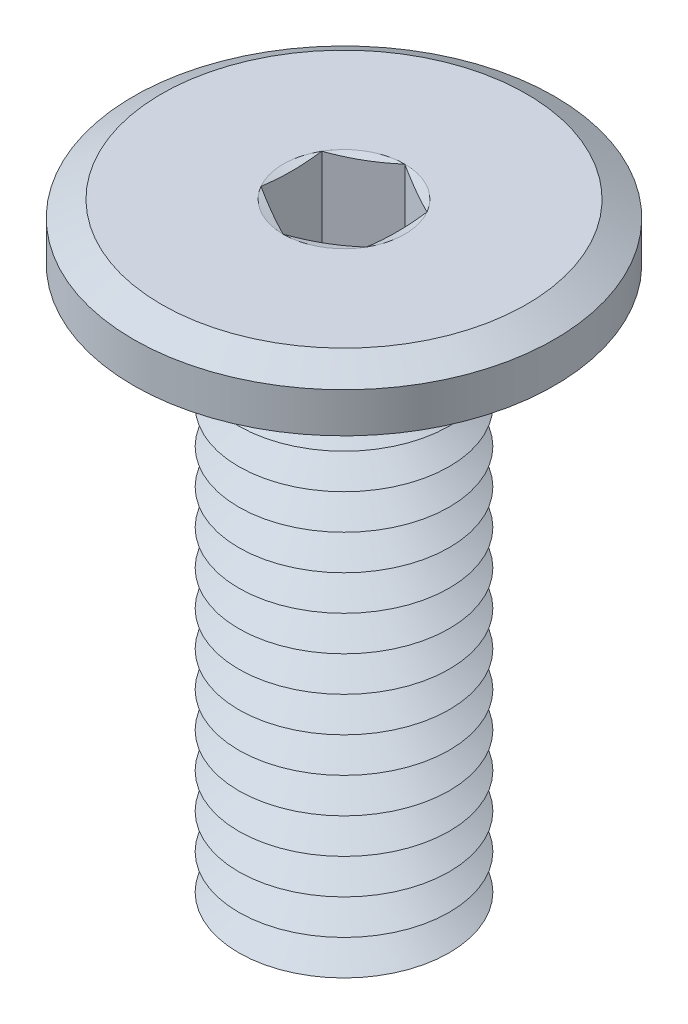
ISO-10303-21;
HEADER;
FILE_DESCRIPTION(('STEP AP214'),'2;1');
FILE_NAME('part.step','',(''),(''),'','','');
FILE_SCHEMA(('AUTOMOTIVE_DESIGN { 1 0 10303 214 1 1 1 1 }'));
ENDSEC;
DATA;
#1=APPLICATION_CONTEXT('core data for automotive mechanical design processes');
#2=APPLICATION_PROTOCOL_DEFINITION('international standard','automotive_design',2000,#1);
#3=PRODUCT_CONTEXT('',#1,'mechanical');
#4=PRODUCT('Part','Part','',(#3));
#5=PRODUCT_RELATED_PRODUCT_CATEGORY('part','',(#4));
#6=PRODUCT_DEFINITION_FORMATION('','',#4);
#7=PRODUCT_DEFINITION_CONTEXT('part definition',#1,'design');
#8=PRODUCT_DEFINITION('design','',#6,#7);
#9=PRODUCT_DEFINITION_SHAPE('','',#8);
#10=(LENGTH_UNIT() NAMED_UNIT(*) SI_UNIT(.MILLI.,.METRE.));
#11=(NAMED_UNIT(*) PLANE_ANGLE_UNIT() SI_UNIT($,.RADIAN.));
#12=(NAMED_UNIT(*) SI_UNIT($,.STERADIAN.) SOLID_ANGLE_UNIT());
#13=UNCERTAINTY_MEASURE_WITH_UNIT(LENGTH_MEASURE(1.E-05),#10,'distance_accuracy_value','');
#14=(GEOMETRIC_REPRESENTATION_CONTEXT(3) GLOBAL_UNCERTAINTY_ASSIGNED_CONTEXT((#13)) GLOBAL_UNIT_ASSIGNED_CONTEXT((#10,
#11,#12)) REPRESENTATION_CONTEXT('',''));
#15=CARTESIAN_POINT('',(0.,0.,0.));
#16=DIRECTION('',(0.,0.,1.));
#17=DIRECTION('',(1.,0.,0.));
#18=AXIS2_PLACEMENT_3D('',#15,#16,#17);
#19=CARTESIAN_POINT('',(0.,-8.05,0.));
#20=DIRECTION('',(0.,-1.,0.));
#21=DIRECTION('',(0.,0.,-1.));
#22=AXIS2_PLACEMENT_3D('',#19,#20,#21);
#23=CONICAL_SURFACE('',#22,1.5,1.0471975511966);
#24=CARTESIAN_POINT('',(0.,-7.8,0.));
#25=DIRECTION('',(0.,1.,0.));
#26=DIRECTION('',(0.,0.,1.));
#27=AXIS2_PLACEMENT_3D('',#24,#25,#26);
#28=CIRCLE('',#27,1.06698729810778);
#29=CARTESIAN_POINT('',(0.,-7.8,1.06698729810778));
#30=VERTEX_POINT('',#29);
#31=EDGE_CURVE('E472',#30,#30,#28,.T.);
#32=ORIENTED_EDGE('',*,*,#31,.F.);
#33=EDGE_LOOP('',(#32));
#34=FACE_BOUND('',#33,.T.);
#35=CARTESIAN_POINT('',(0.,-8.05,0.));
#36=DIRECTION('',(0.,1.,0.));
#37=DIRECTION('',(0.,0.,1.));
#38=AXIS2_PLACEMENT_3D('',#35,#36,#37);
#39=CIRCLE('',#38,1.5);
#40=CARTESIAN_POINT('',(0.,-8.05,1.5));
#41=VERTEX_POINT('',#40);
#42=EDGE_CURVE('E476',#41,#41,#39,.T.);
#43=ORIENTED_EDGE('',*,*,#42,.T.);
#44=EDGE_LOOP('',(#43));
#45=FACE_BOUND('',#44,.T.);
#46=ADVANCED_FACE('F39',(#34,#45),#23,.T.);
#47=CARTESIAN_POINT('',(0.,-7.8,0.));
#48=DIRECTION('',(0.,1.,0.));
#49=DIRECTION('',(0.,0.,1.));
#50=AXIS2_PLACEMENT_3D('',#47,#48,#49);
#51=CONICAL_SURFACE('',#50,1.06698729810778,1.0471975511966);
#52=CARTESIAN_POINT('',(0.,-7.55,0.));
#53=DIRECTION('',(0.,1.,0.));
#54=DIRECTION('',(0.,0.,1.));
#55=AXIS2_PLACEMENT_3D('',#52,#53,#54);
#56=CIRCLE('',#55,1.5);
#57=CARTESIAN_POINT('',(0.,-7.55,1.5));
#58=VERTEX_POINT('',#57);
#59=EDGE_CURVE('E469',#58,#58,#56,.T.);
#60=ORIENTED_EDGE('',*,*,#59,.F.);
#61=EDGE_LOOP('',(#60));
#62=FACE_BOUND('',#61,.T.);
#63=ORIENTED_EDGE('',*,*,#31,.T.);
#64=EDGE_LOOP('',(#63));
#65=FACE_BOUND('',#64,.T.);
#66=ADVANCED_FACE('F232',(#62,#65),#51,.T.);
#67=CARTESIAN_POINT('',(0.,-8.8,0.));
#68=DIRECTION('',(0.,-1.,0.));
#69=DIRECTION('',(0.,0.,-1.));
#70=AXIS2_PLACEMENT_3D('',#67,#68,#69);
#71=PLANE('',#70);
#72=CARTESIAN_POINT('',(0.,-8.8,0.));
#73=DIRECTION('',(0.,1.,0.));
#74=DIRECTION('',(0.,0.,1.));
#75=AXIS2_PLACEMENT_3D('',#72,#73,#74);
#76=CIRCLE('',#75,1.06698729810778);
#77=CARTESIAN_POINT('',(0.,-8.8,1.06698729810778));
#78=VERTEX_POINT('',#77);
#79=EDGE_CURVE('E298',#78,#78,#76,.T.);
#80=ORIENTED_EDGE('',*,*,#79,.F.);
#81=EDGE_LOOP('',(#80));
#82=FACE_BOUND('',#81,.T.);
#83=ADVANCED_FACE('F238',(#82),#71,.T.);
#84=CARTESIAN_POINT('',(0.,-8.8,0.));
#85=DIRECTION('',(0.,1.,0.));
#86=DIRECTION('',(0.,0.,1.));
#87=AXIS2_PLACEMENT_3D('',#84,#85,#86);
#88=CONICAL_SURFACE('',#87,1.06698729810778,1.0471975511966);
#89=CARTESIAN_POINT('',(0.,-8.55,0.));
#90=DIRECTION('',(0.,1.,0.));
#91=DIRECTION('',(0.,0.,1.));
#92=AXIS2_PLACEMENT_3D('',#89,#90,#91);
#93=CIRCLE('',#92,1.5);
#94=CARTESIAN_POINT('',(0.,-8.55,1.5));
#95=VERTEX_POINT('',#94);
#96=EDGE_CURVE('E484',#95,#95,#93,.T.);
#97=ORIENTED_EDGE('',*,*,#96,.F.);
#98=EDGE_LOOP('',(#97));
#99=FACE_BOUND('',#98,.T.);
#100=ORIENTED_EDGE('',*,*,#79,.T.);
#101=EDGE_LOOP('',(#100));
#102=FACE_BOUND('',#101,.T.);
#103=ADVANCED_FACE('F253',(#99,#102),#88,.T.);
#104=CARTESIAN_POINT('',(0.,-8.55,0.));
#105=DIRECTION('',(0.,-1.,0.));
#106=DIRECTION('',(0.,0.,-1.));
#107=AXIS2_PLACEMENT_3D('',#104,#105,#106);
#108=CONICAL_SURFACE('',#107,1.5,1.0471975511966);
#109=CARTESIAN_POINT('',(0.,-8.3,0.));
#110=DIRECTION('',(0.,1.,0.));
#111=DIRECTION('',(0.,0.,1.));
#112=AXIS2_PLACEMENT_3D('',#109,#110,#111);
#113=CIRCLE('',#112,1.06698729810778);
#114=CARTESIAN_POINT('',(0.,-8.3,1.06698729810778));
#115=VERTEX_POINT('',#114);
#116=EDGE_CURVE('E480',#115,#115,#113,.T.);
#117=ORIENTED_EDGE('',*,*,#116,.F.);
#118=EDGE_LOOP('',(#117));
#119=FACE_BOUND('',#118,.T.);
#120=ORIENTED_EDGE('',*,*,#96,.T.);
#121=EDGE_LOOP('',(#120));
#122=FACE_BOUND('',#121,.T.);
#123=ADVANCED_FACE('F249',(#119,#122),#108,.T.);
#124=CARTESIAN_POINT('',(0.,-8.3,0.));
#125=DIRECTION('',(0.,1.,0.));
#126=DIRECTION('',(0.,0.,1.));
#127=AXIS2_PLACEMENT_3D('',#124,#125,#126);
#128=CONICAL_SURFACE('',#127,1.06698729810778,1.0471975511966);
#129=ORIENTED_EDGE('',*,*,#42,.F.);
#130=EDGE_LOOP('',(#129));
#131=FACE_BOUND('',#130,.T.);
#132=ORIENTED_EDGE('',*,*,#116,.T.);
#133=EDGE_LOOP('',(#132));
#134=FACE_BOUND('',#133,.T.);
#135=ADVANCED_FACE('F245',(#131,#134),#128,.T.);
#136=CARTESIAN_POINT('',(0.,-7.55,0.));
#137=DIRECTION('',(0.,-1.,0.));
#138=DIRECTION('',(0.,0.,-1.));
#139=AXIS2_PLACEMENT_3D('',#136,#137,#138);
#140=CONICAL_SURFACE('',#139,1.5,1.0471975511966);
#141=CARTESIAN_POINT('',(0.,-7.3,0.));
#142=DIRECTION('',(0.,1.,0.));
#143=DIRECTION('',(0.,0.,1.));
#144=AXIS2_PLACEMENT_3D('',#141,#142,#143);
#145=CIRCLE('',#144,1.06698729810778);
#146=CARTESIAN_POINT('',(0.,-7.3,1.06698729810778));
#147=VERTEX_POINT('',#146);
#148=EDGE_CURVE('E466',#147,#147,#145,.T.);
#149=ORIENTED_EDGE('',*,*,#148,.F.);
#150=EDGE_LOOP('',(#149));
#151=FACE_BOUND('',#150,.T.);
#152=ORIENTED_EDGE('',*,*,#59,.T.);
#153=EDGE_LOOP('',(#152));
#154=FACE_BOUND('',#153,.T.);
#155=ADVANCED_FACE('F248',(#151,#154),#140,.T.);
#156=CARTESIAN_POINT('',(0.,-7.3,0.));
#157=DIRECTION('',(0.,1.,0.));
#158=DIRECTION('',(0.,0.,1.));
#159=AXIS2_PLACEMENT_3D('',#156,#157,#158);
#160=CONICAL_SURFACE('',#159,1.06698729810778,1.0471975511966);
#161=CARTESIAN_POINT('',(0.,-7.05,0.));
#162=DIRECTION('',(0.,1.,0.));
#163=DIRECTION('',(0.,0.,1.));
#164=AXIS2_PLACEMENT_3D('',#161,#162,#163);
#165=CIRCLE('',#164,1.5);
#166=CARTESIAN_POINT('',(0.,-7.05,1.5));
#167=VERTEX_POINT('',#166);
#168=EDGE_CURVE('E462',#167,#167,#165,.T.);
#169=ORIENTED_EDGE('',*,*,#168,.F.);
#170=EDGE_LOOP('',(#169));
#171=FACE_BOUND('',#170,.T.);
#172=ORIENTED_EDGE('',*,*,#148,.T.);
#173=EDGE_LOOP('',(#172));
#174=FACE_BOUND('',#173,.T.);
#175=ADVANCED_FACE('F635',(#171,#174),#160,.T.);
#176=CARTESIAN_POINT('',(0.,-7.05,0.));
#177=DIRECTION('',(0.,-1.,0.));
#178=DIRECTION('',(0.,0.,-1.));
#179=AXIS2_PLACEMENT_3D('',#176,#177,#178);
#180=CONICAL_SURFACE('',#179,1.5,1.0471975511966);
#181=CARTESIAN_POINT('',(0.,-6.8,0.));
#182=DIRECTION('',(0.,1.,0.));
#183=DIRECTION('',(0.,0.,1.));
#184=AXIS2_PLACEMENT_3D('',#181,#182,#183);
#185=CIRCLE('',#184,1.06698729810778);
#186=CARTESIAN_POINT('',(0.,-6.8,1.06698729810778));
#187=VERTEX_POINT('',#186);
#188=EDGE_CURVE('E458',#187,#187,#185,.T.);
#189=ORIENTED_EDGE('',*,*,#188,.F.);
#190=EDGE_LOOP('',(#189));
#191=FACE_BOUND('',#190,.T.);
#192=ORIENTED_EDGE('',*,*,#168,.T.);
#193=EDGE_LOOP('',(#192));
#194=FACE_BOUND('',#193,.T.);
#195=ADVANCED_FACE('F631',(#191,#194),#180,.T.);
#196=CARTESIAN_POINT('',(0.,-6.8,0.));
#197=DIRECTION('',(0.,1.,0.));
#198=DIRECTION('',(0.,0.,1.));
#199=AXIS2_PLACEMENT_3D('',#196,#197,#198);
#200=CONICAL_SURFACE('',#199,1.06698729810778,1.0471975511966);
#201=CARTESIAN_POINT('',(0.,-6.55,0.));
#202=DIRECTION('',(0.,1.,0.));
#203=DIRECTION('',(0.,0.,1.));
#204=AXIS2_PLACEMENT_3D('',#201,#202,#203);
#205=CIRCLE('',#204,1.5);
#206=CARTESIAN_POINT('',(0.,-6.55,1.5));
#207=VERTEX_POINT('',#206);
#208=EDGE_CURVE('E454',#207,#207,#205,.T.);
#209=ORIENTED_EDGE('',*,*,#208,.F.);
#210=EDGE_LOOP('',(#209));
#211=FACE_BOUND('',#210,.T.);
#212=ORIENTED_EDGE('',*,*,#188,.T.);
#213=EDGE_LOOP('',(#212));
#214=FACE_BOUND('',#213,.T.);
#215=ADVANCED_FACE('F627',(#211,#214),#200,.T.);
#216=CARTESIAN_POINT('',(0.,-6.55,0.));
#217=DIRECTION('',(0.,-1.,0.));
#218=DIRECTION('',(0.,0.,-1.));
#219=AXIS2_PLACEMENT_3D('',#216,#217,#218);
#220=CONICAL_SURFACE('',#219,1.5,1.0471975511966);
#221=CARTESIAN_POINT('',(0.,-6.3,0.));
#222=DIRECTION('',(0.,1.,0.));
#223=DIRECTION('',(0.,0.,1.));
#224=AXIS2_PLACEMENT_3D('',#221,#222,#223);
#225=CIRCLE('',#224,1.06698729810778);
#226=CARTESIAN_POINT('',(0.,-6.3,1.06698729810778));
#227=VERTEX_POINT('',#226);
#228=EDGE_CURVE('E450',#227,#227,#225,.T.);
#229=ORIENTED_EDGE('',*,*,#228,.F.);
#230=EDGE_LOOP('',(#229));
#231=FACE_BOUND('',#230,.T.);
#232=ORIENTED_EDGE('',*,*,#208,.T.);
#233=EDGE_LOOP('',(#232));
#234=FACE_BOUND('',#233,.T.);
#235=ADVANCED_FACE('F623',(#231,#234),#220,.T.);
#236=CARTESIAN_POINT('',(0.,-6.3,0.));
#237=DIRECTION('',(0.,1.,0.));
#238=DIRECTION('',(0.,0.,1.));
#239=AXIS2_PLACEMENT_3D('',#236,#237,#238);
#240=CONICAL_SURFACE('',#239,1.06698729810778,1.0471975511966);
#241=CARTESIAN_POINT('',(0.,-6.05,0.));
#242=DIRECTION('',(0.,1.,0.));
#243=DIRECTION('',(0.,0.,1.));
#244=AXIS2_PLACEMENT_3D('',#241,#242,#243);
#245=CIRCLE('',#244,1.5);
#246=CARTESIAN_POINT('',(0.,-6.05,1.5));
#247=VERTEX_POINT('',#246);
#248=EDGE_CURVE('E446',#247,#247,#245,.T.);
#249=ORIENTED_EDGE('',*,*,#248,.F.);
#250=EDGE_LOOP('',(#249));
#251=FACE_BOUND('',#250,.T.);
#252=ORIENTED_EDGE('',*,*,#228,.T.);
#253=EDGE_LOOP('',(#252));
#254=FACE_BOUND('',#253,.T.);
#255=ADVANCED_FACE('F619',(#251,#254),#240,.T.);
#256=CARTESIAN_POINT('',(0.,-6.05,0.));
#257=DIRECTION('',(0.,-1.,0.));
#258=DIRECTION('',(0.,0.,-1.));
#259=AXIS2_PLACEMENT_3D('',#256,#257,#258);
#260=CONICAL_SURFACE('',#259,1.5,1.0471975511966);
#261=CARTESIAN_POINT('',(0.,-5.8,0.));
#262=DIRECTION('',(0.,1.,0.));
#263=DIRECTION('',(0.,0.,1.));
#264=AXIS2_PLACEMENT_3D('',#261,#262,#263);
#265=CIRCLE('',#264,1.06698729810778);
#266=CARTESIAN_POINT('',(0.,-5.8,1.06698729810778));
#267=VERTEX_POINT('',#266);
#268=EDGE_CURVE('E442',#267,#267,#265,.T.);
#269=ORIENTED_EDGE('',*,*,#268,.F.);
#270=EDGE_LOOP('',(#269));
#271=FACE_BOUND('',#270,.T.);
#272=ORIENTED_EDGE('',*,*,#248,.T.);
#273=EDGE_LOOP('',(#272));
#274=FACE_BOUND('',#273,.T.);
#275=ADVANCED_FACE('F615',(#271,#274),#260,.T.);
#276=CARTESIAN_POINT('',(0.,-5.8,0.));
#277=DIRECTION('',(0.,1.,0.));
#278=DIRECTION('',(0.,0.,1.));
#279=AXIS2_PLACEMENT_3D('',#276,#277,#278);
#280=CONICAL_SURFACE('',#279,1.06698729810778,1.0471975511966);
#281=CARTESIAN_POINT('',(0.,-5.55,0.));
#282=DIRECTION('',(0.,1.,0.));
#283=DIRECTION('',(0.,0.,1.));
#284=AXIS2_PLACEMENT_3D('',#281,#282,#283);
#285=CIRCLE('',#284,1.5);
#286=CARTESIAN_POINT('',(0.,-5.55,1.5));
#287=VERTEX_POINT('',#286);
#288=EDGE_CURVE('E439',#287,#287,#285,.T.);
#289=ORIENTED_EDGE('',*,*,#288,.F.);
#290=EDGE_LOOP('',(#289));
#291=FACE_BOUND('',#290,.T.);
#292=ORIENTED_EDGE('',*,*,#268,.T.);
#293=EDGE_LOOP('',(#292));
#294=FACE_BOUND('',#293,.T.);
#295=ADVANCED_FACE('F611',(#291,#294),#280,.T.);
#296=CARTESIAN_POINT('',(0.,-5.55,0.));
#297=DIRECTION('',(0.,-1.,0.));
#298=DIRECTION('',(0.,0.,-1.));
#299=AXIS2_PLACEMENT_3D('',#296,#297,#298);
#300=CONICAL_SURFACE('',#299,1.5,1.0471975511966);
#301=CARTESIAN_POINT('',(0.,-5.3,0.));
#302=DIRECTION('',(0.,1.,0.));
#303=DIRECTION('',(0.,0.,1.));
#304=AXIS2_PLACEMENT_3D('',#301,#302,#303);
#305=CIRCLE('',#304,1.06698729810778);
#306=CARTESIAN_POINT('',(0.,-5.3,1.06698729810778));
#307=VERTEX_POINT('',#306);
#308=EDGE_CURVE('E435',#307,#307,#305,.T.);
#309=ORIENTED_EDGE('',*,*,#308,.F.);
#310=EDGE_LOOP('',(#309));
#311=FACE_BOUND('',#310,.T.);
#312=ORIENTED_EDGE('',*,*,#288,.T.);
#313=EDGE_LOOP('',(#312));
#314=FACE_BOUND('',#313,.T.);
#315=ADVANCED_FACE('F607',(#311,#314),#300,.T.);
#316=CARTESIAN_POINT('',(0.,-5.3,0.));
#317=DIRECTION('',(0.,1.,0.));
#318=DIRECTION('',(0.,0.,1.));
#319=AXIS2_PLACEMENT_3D('',#316,#317,#318);
#320=CONICAL_SURFACE('',#319,1.06698729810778,1.0471975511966);
#321=CARTESIAN_POINT('',(0.,-5.05,0.));
#322=DIRECTION('',(0.,1.,0.));
#323=DIRECTION('',(0.,0.,1.));
#324=AXIS2_PLACEMENT_3D('',#321,#322,#323);
#325=CIRCLE('',#324,1.5);
#326=CARTESIAN_POINT('',(0.,-5.05,1.5));
#327=VERTEX_POINT('',#326);
#328=EDGE_CURVE('E431',#327,#327,#325,.T.);
#329=ORIENTED_EDGE('',*,*,#328,.F.);
#330=EDGE_LOOP('',(#329));
#331=FACE_BOUND('',#330,.T.);
#332=ORIENTED_EDGE('',*,*,#308,.T.);
#333=EDGE_LOOP('',(#332));
#334=FACE_BOUND('',#333,.T.);
#335=ADVANCED_FACE('F603',(#331,#334),#320,.T.);
#336=CARTESIAN_POINT('',(0.,-5.05,0.));
#337=DIRECTION('',(0.,-1.,0.));
#338=DIRECTION('',(0.,0.,-1.));
#339=AXIS2_PLACEMENT_3D('',#336,#337,#338);
#340=CONICAL_SURFACE('',#339,1.5,1.0471975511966);
#341=CARTESIAN_POINT('',(0.,-4.8,0.));
#342=DIRECTION('',(0.,1.,0.));
#343=DIRECTION('',(0.,0.,1.));
#344=AXIS2_PLACEMENT_3D('',#341,#342,#343);
#345=CIRCLE('',#344,1.06698729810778);
#346=CARTESIAN_POINT('',(0.,-4.8,1.06698729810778));
#347=VERTEX_POINT('',#346);
#348=EDGE_CURVE('E427',#347,#347,#345,.T.);
#349=ORIENTED_EDGE('',*,*,#348,.F.);
#350=EDGE_LOOP('',(#349));
#351=FACE_BOUND('',#350,.T.);
#352=ORIENTED_EDGE('',*,*,#328,.T.);
#353=EDGE_LOOP('',(#352));
#354=FACE_BOUND('',#353,.T.);
#355=ADVANCED_FACE('F599',(#351,#354),#340,.T.);
#356=CARTESIAN_POINT('',(0.,-4.8,0.));
#357=DIRECTION('',(0.,1.,0.));
#358=DIRECTION('',(0.,0.,1.));
#359=AXIS2_PLACEMENT_3D('',#356,#357,#358);
#360=CONICAL_SURFACE('',#359,1.06698729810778,1.0471975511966);
#361=CARTESIAN_POINT('',(0.,-4.55,0.));
#362=DIRECTION('',(0.,1.,0.));
#363=DIRECTION('',(0.,0.,1.));
#364=AXIS2_PLACEMENT_3D('',#361,#362,#363);
#365=CIRCLE('',#364,1.5);
#366=CARTESIAN_POINT('',(0.,-4.55,1.5));
#367=VERTEX_POINT('',#366);
#368=EDGE_CURVE('E423',#367,#367,#365,.T.);
#369=ORIENTED_EDGE('',*,*,#368,.F.);
#370=EDGE_LOOP('',(#369));
#371=FACE_BOUND('',#370,.T.);
#372=ORIENTED_EDGE('',*,*,#348,.T.);
#373=EDGE_LOOP('',(#372));
#374=FACE_BOUND('',#373,.T.);
#375=ADVANCED_FACE('F595',(#371,#374),#360,.T.);
#376=CARTESIAN_POINT('',(0.,-4.55,0.));
#377=DIRECTION('',(0.,-1.,0.));
#378=DIRECTION('',(0.,0.,-1.));
#379=AXIS2_PLACEMENT_3D('',#376,#377,#378);
#380=CONICAL_SURFACE('',#379,1.5,1.0471975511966);
#381=CARTESIAN_POINT('',(0.,-4.3,0.));
#382=DIRECTION('',(0.,1.,0.));
#383=DIRECTION('',(0.,0.,1.));
#384=AXIS2_PLACEMENT_3D('',#381,#382,#383);
#385=CIRCLE('',#384,1.06698729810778);
#386=CARTESIAN_POINT('',(0.,-4.3,1.06698729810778));
#387=VERTEX_POINT('',#386);
#388=EDGE_CURVE('E419',#387,#387,#385,.T.);
#389=ORIENTED_EDGE('',*,*,#388,.F.);
#390=EDGE_LOOP('',(#389));
#391=FACE_BOUND('',#390,.T.);
#392=ORIENTED_EDGE('',*,*,#368,.T.);
#393=EDGE_LOOP('',(#392));
#394=FACE_BOUND('',#393,.T.);
#395=ADVANCED_FACE('F591',(#391,#394),#380,.T.);
#396=CARTESIAN_POINT('',(0.,-4.3,0.));
#397=DIRECTION('',(0.,1.,0.));
#398=DIRECTION('',(0.,0.,1.));
#399=AXIS2_PLACEMENT_3D('',#396,#397,#398);
#400=CONICAL_SURFACE('',#399,1.06698729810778,1.0471975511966);
#401=CARTESIAN_POINT('',(0.,-4.05,0.));
#402=DIRECTION('',(0.,1.,0.));
#403=DIRECTION('',(0.,0.,1.));
#404=AXIS2_PLACEMENT_3D('',#401,#402,#403);
#405=CIRCLE('',#404,1.5);
#406=CARTESIAN_POINT('',(0.,-4.05,1.5));
#407=VERTEX_POINT('',#406);
#408=EDGE_CURVE('E416',#407,#407,#405,.T.);
#409=ORIENTED_EDGE('',*,*,#408,.F.);
#410=EDGE_LOOP('',(#409));
#411=FACE_BOUND('',#410,.T.);
#412=ORIENTED_EDGE('',*,*,#388,.T.);
#413=EDGE_LOOP('',(#412));
#414=FACE_BOUND('',#413,.T.);
#415=ADVANCED_FACE('F587',(#411,#414),#400,.T.);
#416=CARTESIAN_POINT('',(0.,-4.05,0.));
#417=DIRECTION('',(0.,-1.,0.));
#418=DIRECTION('',(0.,0.,-1.));
#419=AXIS2_PLACEMENT_3D('',#416,#417,#418);
#420=CONICAL_SURFACE('',#419,1.5,1.0471975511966);
#421=CARTESIAN_POINT('',(0.,-3.8,0.));
#422=DIRECTION('',(0.,1.,0.));
#423=DIRECTION('',(0.,0.,1.));
#424=AXIS2_PLACEMENT_3D('',#421,#422,#423);
#425=CIRCLE('',#424,1.06698729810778);
#426=CARTESIAN_POINT('',(0.,-3.8,1.06698729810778));
#427=VERTEX_POINT('',#426);
#428=EDGE_CURVE('E412',#427,#427,#425,.T.);
#429=ORIENTED_EDGE('',*,*,#428,.F.);
#430=EDGE_LOOP('',(#429));
#431=FACE_BOUND('',#430,.T.);
#432=ORIENTED_EDGE('',*,*,#408,.T.);
#433=EDGE_LOOP('',(#432));
#434=FACE_BOUND('',#433,.T.);
#435=ADVANCED_FACE('F583',(#431,#434),#420,.T.);
#436=CARTESIAN_POINT('',(0.,-3.8,0.));
#437=DIRECTION('',(0.,1.,0.));
#438=DIRECTION('',(0.,0.,1.));
#439=AXIS2_PLACEMENT_3D('',#436,#437,#438);
#440=CONICAL_SURFACE('',#439,1.06698729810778,1.0471975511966);
#441=CARTESIAN_POINT('',(0.,-3.55,0.));
#442=DIRECTION('',(0.,1.,0.));
#443=DIRECTION('',(0.,0.,1.));
#444=AXIS2_PLACEMENT_3D('',#441,#442,#443);
#445=CIRCLE('',#444,1.5);
#446=CARTESIAN_POINT('',(0.,-3.55,1.5));
#447=VERTEX_POINT('',#446);
#448=EDGE_CURVE('E408',#447,#447,#445,.T.);
#449=ORIENTED_EDGE('',*,*,#448,.F.);
#450=EDGE_LOOP('',(#449));
#451=FACE_BOUND('',#450,.T.);
#452=ORIENTED_EDGE('',*,*,#428,.T.);
#453=EDGE_LOOP('',(#452));
#454=FACE_BOUND('',#453,.T.);
#455=ADVANCED_FACE('F579',(#451,#454),#440,.T.);
#456=CARTESIAN_POINT('',(0.,-3.55,0.));
#457=DIRECTION('',(0.,-1.,0.));
#458=DIRECTION('',(0.,0.,-1.));
#459=AXIS2_PLACEMENT_3D('',#456,#457,#458);
#460=CONICAL_SURFACE('',#459,1.5,1.0471975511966);
#461=CARTESIAN_POINT('',(0.,-3.3,0.));
#462=DIRECTION('',(0.,1.,0.));
#463=DIRECTION('',(0.,0.,1.));
#464=AXIS2_PLACEMENT_3D('',#461,#462,#463);
#465=CIRCLE('',#464,1.06698729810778);
#466=CARTESIAN_POINT('',(0.,-3.3,1.06698729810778));
#467=VERTEX_POINT('',#466);
#468=EDGE_CURVE('E404',#467,#467,#465,.T.);
#469=ORIENTED_EDGE('',*,*,#468,.F.);
#470=EDGE_LOOP('',(#469));
#471=FACE_BOUND('',#470,.T.);
#472=ORIENTED_EDGE('',*,*,#448,.T.);
#473=EDGE_LOOP('',(#472));
#474=FACE_BOUND('',#473,.T.);
#475=ADVANCED_FACE('F575',(#471,#474),#460,.T.);
#476=CARTESIAN_POINT('',(0.,-3.3,0.));
#477=DIRECTION('',(0.,1.,0.));
#478=DIRECTION('',(0.,0.,1.));
#479=AXIS2_PLACEMENT_3D('',#476,#477,#478);
#480=CONICAL_SURFACE('',#479,1.06698729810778,1.0471975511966);
#481=CARTESIAN_POINT('',(0.,-3.05,0.));
#482=DIRECTION('',(0.,1.,0.));
#483=DIRECTION('',(0.,0.,1.));
#484=AXIS2_PLACEMENT_3D('',#481,#482,#483);
#485=CIRCLE('',#484,1.5);
#486=CARTESIAN_POINT('',(0.,-3.05,1.5));
#487=VERTEX_POINT('',#486);
#488=EDGE_CURVE('E400',#487,#487,#485,.T.);
#489=ORIENTED_EDGE('',*,*,#488,.F.);
#490=EDGE_LOOP('',(#489));
#491=FACE_BOUND('',#490,.T.);
#492=ORIENTED_EDGE('',*,*,#468,.T.);
#493=EDGE_LOOP('',(#492));
#494=FACE_BOUND('',#493,.T.);
#495=ADVANCED_FACE('F571',(#491,#494),#480,.T.);
#496=CARTESIAN_POINT('',(0.,-3.05,0.));
#497=DIRECTION('',(0.,-1.,0.));
#498=DIRECTION('',(0.,0.,-1.));
#499=AXIS2_PLACEMENT_3D('',#496,#497,#498);
#500=CONICAL_SURFACE('',#499,1.5,1.0471975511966);
#501=CARTESIAN_POINT('',(0.,-2.8,0.));
#502=DIRECTION('',(0.,1.,0.));
#503=DIRECTION('',(0.,0.,1.));
#504=AXIS2_PLACEMENT_3D('',#501,#502,#503);
#505=CIRCLE('',#504,1.06698729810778);
#506=CARTESIAN_POINT('',(0.,-2.8,1.06698729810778));
#507=VERTEX_POINT('',#506);
#508=EDGE_CURVE('E396',#507,#507,#505,.T.);
#509=ORIENTED_EDGE('',*,*,#508,.F.);
#510=EDGE_LOOP('',(#509));
#511=FACE_BOUND('',#510,.T.);
#512=ORIENTED_EDGE('',*,*,#488,.T.);
#513=EDGE_LOOP('',(#512));
#514=FACE_BOUND('',#513,.T.);
#515=ADVANCED_FACE('F567',(#511,#514),#500,.T.);
#516=CARTESIAN_POINT('',(0.,-2.8,0.));
#517=DIRECTION('',(0.,1.,0.));
#518=DIRECTION('',(0.,0.,1.));
#519=AXIS2_PLACEMENT_3D('',#516,#517,#518);
#520=CONICAL_SURFACE('',#519,1.06698729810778,1.0471975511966);
#521=CARTESIAN_POINT('',(0.,-2.55,0.));
#522=DIRECTION('',(0.,1.,0.));
#523=DIRECTION('',(0.,0.,1.));
#524=AXIS2_PLACEMENT_3D('',#521,#522,#523);
#525=CIRCLE('',#524,1.5);
#526=CARTESIAN_POINT('',(0.,-2.55,1.5));
#527=VERTEX_POINT('',#526);
#528=EDGE_CURVE('E392',#527,#527,#525,.T.);
#529=ORIENTED_EDGE('',*,*,#528,.F.);
#530=EDGE_LOOP('',(#529));
#531=FACE_BOUND('',#530,.T.);
#532=ORIENTED_EDGE('',*,*,#508,.T.);
#533=EDGE_LOOP('',(#532));
#534=FACE_BOUND('',#533,.T.);
#535=ADVANCED_FACE('F563',(#531,#534),#520,.T.);
#536=CARTESIAN_POINT('',(0.,-2.55,0.));
#537=DIRECTION('',(0.,-1.,0.));
#538=DIRECTION('',(0.,0.,-1.));
#539=AXIS2_PLACEMENT_3D('',#536,#537,#538);
#540=CONICAL_SURFACE('',#539,1.5,1.0471975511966);
#541=CARTESIAN_POINT('',(0.,-2.3,0.));
#542=DIRECTION('',(0.,1.,0.));
#543=DIRECTION('',(0.,0.,1.));
#544=AXIS2_PLACEMENT_3D('',#541,#542,#543);
#545=CIRCLE('',#544,1.06698729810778);
#546=CARTESIAN_POINT('',(0.,-2.3,1.06698729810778));
#547=VERTEX_POINT('',#546);
#548=EDGE_CURVE('E388',#547,#547,#545,.T.);
#549=ORIENTED_EDGE('',*,*,#548,.F.);
#550=EDGE_LOOP('',(#549));
#551=FACE_BOUND('',#550,.T.);
#552=ORIENTED_EDGE('',*,*,#528,.T.);
#553=EDGE_LOOP('',(#552));
#554=FACE_BOUND('',#553,.T.);
#555=ADVANCED_FACE('F559',(#551,#554),#540,.T.);
#556=CARTESIAN_POINT('',(0.,-2.3,0.));
#557=DIRECTION('',(0.,1.,0.));
#558=DIRECTION('',(0.,0.,1.));
#559=AXIS2_PLACEMENT_3D('',#556,#557,#558);
#560=CONICAL_SURFACE('',#559,1.06698729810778,1.0471975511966);
#561=CARTESIAN_POINT('',(0.,-2.05,0.));
#562=DIRECTION('',(0.,1.,0.));
#563=DIRECTION('',(0.,0.,1.));
#564=AXIS2_PLACEMENT_3D('',#561,#562,#563);
#565=CIRCLE('',#564,1.5);
#566=CARTESIAN_POINT('',(0.,-2.05,1.5));
#567=VERTEX_POINT('',#566);
#568=EDGE_CURVE('E384',#567,#567,#565,.T.);
#569=ORIENTED_EDGE('',*,*,#568,.F.);
#570=EDGE_LOOP('',(#569));
#571=FACE_BOUND('',#570,.T.);
#572=ORIENTED_EDGE('',*,*,#548,.T.);
#573=EDGE_LOOP('',(#572));
#574=FACE_BOUND('',#573,.T.);
#575=ADVANCED_FACE('F555',(#571,#574),#560,.T.);
#576=CARTESIAN_POINT('',(0.,-2.05,0.));
#577=DIRECTION('',(0.,-1.,0.));
#578=DIRECTION('',(0.,0.,-1.));
#579=AXIS2_PLACEMENT_3D('',#576,#577,#578);
#580=CONICAL_SURFACE('',#579,1.5,1.0471975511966);
#581=CARTESIAN_POINT('',(0.,-1.8,0.));
#582=DIRECTION('',(0.,1.,0.));
#583=DIRECTION('',(0.,0.,1.));
#584=AXIS2_PLACEMENT_3D('',#581,#582,#583);
#585=CIRCLE('',#584,1.06698729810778);
#586=CARTESIAN_POINT('',(0.,-1.8,1.06698729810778));
#587=VERTEX_POINT('',#586);
#588=EDGE_CURVE('E380',#587,#587,#585,.T.);
#589=ORIENTED_EDGE('',*,*,#588,.F.);
#590=EDGE_LOOP('',(#589));
#591=FACE_BOUND('',#590,.T.);
#592=ORIENTED_EDGE('',*,*,#568,.T.);
#593=EDGE_LOOP('',(#592));
#594=FACE_BOUND('',#593,.T.);
#595=ADVANCED_FACE('F551',(#591,#594),#580,.T.);
#596=CARTESIAN_POINT('',(0.,-1.8,0.));
#597=DIRECTION('',(0.,1.,0.));
#598=DIRECTION('',(0.,0.,1.));
#599=AXIS2_PLACEMENT_3D('',#596,#597,#598);
#600=CONICAL_SURFACE('',#599,1.06698729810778,1.0471975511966);
#601=CARTESIAN_POINT('',(0.,-1.55,0.));
#602=DIRECTION('',(0.,1.,0.));
#603=DIRECTION('',(0.,0.,1.));
#604=AXIS2_PLACEMENT_3D('',#601,#602,#603);
#605=CIRCLE('',#604,1.5);
#606=CARTESIAN_POINT('',(0.,-1.55,1.5));
#607=VERTEX_POINT('',#606);
#608=EDGE_CURVE('E364',#607,#607,#605,.T.);
#609=ORIENTED_EDGE('',*,*,#608,.F.);
#610=EDGE_LOOP('',(#609));
#611=FACE_BOUND('',#610,.T.);
#612=ORIENTED_EDGE('',*,*,#588,.T.);
#613=EDGE_LOOP('',(#612));
#614=FACE_BOUND('',#613,.T.);
#615=ADVANCED_FACE('F273',(#611,#614),#600,.T.);
#616=CARTESIAN_POINT('',(0.,0.,0.));
#617=DIRECTION('',(0.,1.,0.));
#618=DIRECTION('',(0.,0.,1.));
#619=AXIS2_PLACEMENT_3D('',#616,#617,#618);
#620=PLANE('',#619);
#621=CARTESIAN_POINT('',(0.,0.,0.));
#622=DIRECTION('',(0.,1.,0.));
#623=DIRECTION('',(0.,0.,1.));
#624=AXIS2_PLACEMENT_3D('',#621,#622,#623);
#625=CIRCLE('',#624,0.866025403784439);
#626=CARTESIAN_POINT('',(0.,0.,0.866025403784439));
#627=VERTEX_POINT('',#626);
#628=CARTESIAN_POINT('',(0.75,0.,0.43301270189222));
#629=VERTEX_POINT('',#628);
#630=EDGE_CURVE('E66',#627,#629,#625,.T.);
#631=ORIENTED_EDGE('',*,*,#630,.F.);
#632=CARTESIAN_POINT('',(-0.75,0.,0.433012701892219));
#633=VERTEX_POINT('',#632);
#634=EDGE_CURVE('E168',#633,#627,#625,.T.);
#635=ORIENTED_EDGE('',*,*,#634,.F.);
#636=CARTESIAN_POINT('',(-0.75,0.,-0.43301270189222));
#637=VERTEX_POINT('',#636);
#638=EDGE_CURVE('E164',#637,#633,#625,.T.);
#639=ORIENTED_EDGE('',*,*,#638,.F.);
#640=CARTESIAN_POINT('',(0.,0.,-0.866025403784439));
#641=VERTEX_POINT('',#640);
#642=EDGE_CURVE('E128',#641,#637,#625,.T.);
#643=ORIENTED_EDGE('',*,*,#642,.F.);
#644=CARTESIAN_POINT('',(0.75,0.,-0.43301270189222));
#645=VERTEX_POINT('',#644);
#646=EDGE_CURVE('E119',#645,#641,#625,.T.);
#647=ORIENTED_EDGE('',*,*,#646,.F.);
#648=EDGE_CURVE('E59',#629,#645,#625,.T.);
#649=ORIENTED_EDGE('',*,*,#648,.F.);
#650=EDGE_LOOP('',(#631,#635,#639,#643,#647,#649));
#651=FACE_BOUND('',#650,.T.);
#652=CARTESIAN_POINT('',(0.,0.,0.));
#653=DIRECTION('',(0.,1.,0.));
#654=DIRECTION('',(0.,0.,1.));
#655=AXIS2_PLACEMENT_3D('',#652,#653,#654);
#656=CIRCLE('',#655,2.6);
#657=CARTESIAN_POINT('',(0.,0.,2.6));
#658=VERTEX_POINT('',#657);
#659=EDGE_CURVE('E294',#658,#658,#656,.T.);
#660=ORIENTED_EDGE('',*,*,#659,.T.);
#661=EDGE_LOOP('',(#660));
#662=FACE_BOUND('',#661,.T.);
#663=ADVANCED_FACE('F160',(#651,#662),#620,.T.);
#664=CARTESIAN_POINT('',(0.,-0.8,0.));
#665=DIRECTION('',(0.,1.,0.));
#666=DIRECTION('',(0.,0.,1.));
#667=AXIS2_PLACEMENT_3D('',#664,#665,#666);
#668=CYLINDRICAL_SURFACE('',#667,3.);
#669=CARTESIAN_POINT('',(0.,-0.230940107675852,0.));
#670=DIRECTION('',(0.,1.,0.));
#671=DIRECTION('',(0.,0.,1.));
#672=AXIS2_PLACEMENT_3D('',#669,#670,#671);
#673=CIRCLE('',#672,3.);
#674=CARTESIAN_POINT('',(0.,-0.230940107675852,3.));
#675=VERTEX_POINT('',#674);
#676=EDGE_CURVE('E305',#675,#675,#673,.F.);
#677=ORIENTED_EDGE('',*,*,#676,.T.);
#678=EDGE_LOOP('',(#677));
#679=FACE_BOUND('',#678,.T.);
#680=CARTESIAN_POINT('',(0.,-0.8,0.));
#681=DIRECTION('',(0.,1.,0.));
#682=DIRECTION('',(0.,0.,1.));
#683=AXIS2_PLACEMENT_3D('',#680,#681,#682);
#684=CIRCLE('',#683,3.);
#685=CARTESIAN_POINT('',(0.,-0.8,3.));
#686=VERTEX_POINT('',#685);
#687=EDGE_CURVE('E290',#686,#686,#684,.T.);
#688=ORIENTED_EDGE('',*,*,#687,.T.);
#689=EDGE_LOOP('',(#688));
#690=FACE_BOUND('',#689,.T.);
#691=ADVANCED_FACE('F269',(#679,#690),#668,.T.);
#692=CARTESIAN_POINT('',(0.,-0.8,0.));
#693=DIRECTION('',(0.,1.,0.));
#694=DIRECTION('',(0.,0.,1.));
#695=AXIS2_PLACEMENT_3D('',#692,#693,#694);
#696=PLANE('',#695);
#697=CARTESIAN_POINT('',(0.,-0.8,0.));
#698=DIRECTION('',(0.,1.,0.));
#699=DIRECTION('',(0.,0.,1.));
#700=AXIS2_PLACEMENT_3D('',#697,#698,#699);
#701=CIRCLE('',#700,1.6);
#702=CARTESIAN_POINT('',(0.,-0.8,1.6));
#703=VERTEX_POINT('',#702);
#704=EDGE_CURVE('E285',#703,#703,#701,.T.);
#705=ORIENTED_EDGE('',*,*,#704,.T.);
#706=EDGE_LOOP('',(#705));
#707=FACE_BOUND('',#706,.T.);
#708=ORIENTED_EDGE('',*,*,#687,.F.);
#709=EDGE_LOOP('',(#708));
#710=FACE_BOUND('',#709,.T.);
#711=ADVANCED_FACE('F265',(#707,#710),#696,.F.);
#712=CARTESIAN_POINT('',(0.,-8.8,0.));
#713=DIRECTION('',(0.,1.,0.));
#714=DIRECTION('',(0.,0.,1.));
#715=AXIS2_PLACEMENT_3D('',#712,#713,#714);
#716=CYLINDRICAL_SURFACE('',#715,1.5);
#717=CARTESIAN_POINT('',(0.,-0.9,0.));
#718=DIRECTION('',(0.,1.,0.));
#719=DIRECTION('',(0.,0.,1.));
#720=AXIS2_PLACEMENT_3D('',#717,#718,#719);
#721=CIRCLE('',#720,1.5);
#722=CARTESIAN_POINT('',(0.,-0.9,1.5));
#723=VERTEX_POINT('',#722);
#724=EDGE_CURVE('E288',#723,#723,#721,.F.);
#725=ORIENTED_EDGE('',*,*,#724,.T.);
#726=EDGE_LOOP('',(#725));
#727=FACE_BOUND('',#726,.T.);
#728=ORIENTED_EDGE('',*,*,#608,.T.);
#729=EDGE_LOOP('',(#728));
#730=FACE_BOUND('',#729,.T.);
#731=ADVANCED_FACE('F261',(#727,#730),#716,.T.);
#732=CARTESIAN_POINT('',(0.,-0.9,0.));
#733=DIRECTION('',(0.,1.,0.));
#734=DIRECTION('',(0.,0.,1.));
#735=AXIS2_PLACEMENT_3D('',#732,#733,#734);
#736=TOROIDAL_SURFACE('',#735,1.6,0.1);
#737=ORIENTED_EDGE('',*,*,#704,.F.);
#738=EDGE_LOOP('',(#737));
#739=FACE_BOUND('',#738,.T.);
#740=ORIENTED_EDGE('',*,*,#724,.F.);
#741=EDGE_LOOP('',(#740));
#742=FACE_BOUND('',#741,.T.);
#743=ADVANCED_FACE('F264',(#739,#742),#736,.F.);
#744=CARTESIAN_POINT('',(0.,0.,0.));
#745=DIRECTION('',(0.,-1.,0.));
#746=DIRECTION('',(0.,0.,-1.));
#747=AXIS2_PLACEMENT_3D('',#744,#745,#746);
#748=CONICAL_SURFACE('',#747,2.6,1.0471975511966);
#749=ORIENTED_EDGE('',*,*,#676,.F.);
#750=EDGE_LOOP('',(#749));
#751=FACE_BOUND('',#750,.T.);
#752=ORIENTED_EDGE('',*,*,#659,.F.);
#753=EDGE_LOOP('',(#752));
#754=FACE_BOUND('',#753,.T.);
#755=ADVANCED_FACE('F41',(#751,#754),#748,.T.);
#756=CARTESIAN_POINT('',(0.,0.,0.));
#757=DIRECTION('',(0.,1.,0.));
#758=DIRECTION('',(0.,0.,1.));
#759=AXIS2_PLACEMENT_3D('',#756,#757,#758);
#760=CONICAL_SURFACE('',#759,0.866025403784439,1.30899693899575);
#761=ORIENTED_EDGE('',*,*,#642,.T.);
#762=CARTESIAN_POINT('',(0.00020000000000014,3.0946294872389E-05,-0.866140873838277));
#763=CARTESIAN_POINT('',(-0.0309621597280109,-0.00479360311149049,-0.84814939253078));
#764=CARTESIAN_POINT('',(-0.0621808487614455,-0.00917362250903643,-0.830125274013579));
#765=CARTESIAN_POINT('',(-0.124728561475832,-0.0168690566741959,-0.794013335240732));
#766=CARTESIAN_POINT('',(-0.156057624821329,-0.0201840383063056,-0.775925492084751));
#767=CARTESIAN_POINT('',(-0.21863598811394,-0.0255557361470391,-0.739795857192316));
#768=CARTESIAN_POINT('',(-0.2498848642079,-0.0276188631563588,-0.721754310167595));
#769=CARTESIAN_POINT('',(-0.312422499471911,-0.0303853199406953,-0.685648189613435));
#770=CARTESIAN_POINT('',(-0.343711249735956,-0.0310889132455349,-0.667583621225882));
#771=CARTESIAN_POINT('',(-0.406288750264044,-0.0310889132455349,-0.631454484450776));
#772=CARTESIAN_POINT('',(-0.437577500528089,-0.0303853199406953,-0.613389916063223));
#773=CARTESIAN_POINT('',(-0.5001151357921,-0.0276188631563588,-0.577283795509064));
#774=CARTESIAN_POINT('',(-0.53136401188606,-0.0255557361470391,-0.559242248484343));
#775=CARTESIAN_POINT('',(-0.593942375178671,-0.0201840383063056,-0.523112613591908));
#776=CARTESIAN_POINT('',(-0.625271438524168,-0.0168690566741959,-0.505024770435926));
#777=CARTESIAN_POINT('',(-0.687819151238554,-0.00917362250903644,-0.46891283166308));
#778=CARTESIAN_POINT('',(-0.719037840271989,-0.0047936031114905,-0.450888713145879));
#779=CARTESIAN_POINT('',(-0.7502,3.09462948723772E-05,-0.432897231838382));
#780=B_SPLINE_CURVE_WITH_KNOTS('',3,(#762,#763,#764,#765,#766,#767,#768,#769,#770,#771,#772,
#773,#774,#775,#776,#777,#778,#779),.UNSPECIFIED.,.F.,.F.,(4,2,2,2,2,2,2,2,4),(0.,
0.108920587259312,0.217885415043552,0.326287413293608,0.434668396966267,0.543049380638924,
0.651451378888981,0.760416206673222,0.869336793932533),.UNSPECIFIED.);
#781=EDGE_CURVE('E11',#641,#637,#780,.T.);
#782=ORIENTED_EDGE('',*,*,#781,.F.);
#783=EDGE_LOOP('',(#761,#782));
#784=FACE_BOUND('',#783,.T.);
#785=ADVANCED_FACE('F132',(#784),#760,.F.);
#786=ORIENTED_EDGE('',*,*,#638,.T.);
#787=CARTESIAN_POINT('',(-0.75,0.177029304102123,-1.32978817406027));
#788=CARTESIAN_POINT('',(-0.75,0.162091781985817,-1.26569678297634));
#789=CARTESIAN_POINT('',(-0.75,0.147363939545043,-1.20155322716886));
#790=CARTESIAN_POINT('',(-0.75,0.118617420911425,-1.07309552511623));
#791=CARTESIAN_POINT('',(-0.75,0.10459887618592,-1.00878134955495));
#792=CARTESIAN_POINT('',(-0.75,0.0774349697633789,-0.879312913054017));
#793=CARTESIAN_POINT('',(-0.75,0.0642994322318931,-0.814156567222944));
#794=CARTESIAN_POINT('',(-0.75,0.0395688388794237,-0.683540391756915));
#795=CARTESIAN_POINT('',(-0.75,0.0279739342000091,-0.618080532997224));
#796=CARTESIAN_POINT('',(-0.75,0.00739697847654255,-0.488585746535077));
#797=CARTESIAN_POINT('',(-0.75,-0.00164814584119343,-0.424561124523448));
#798=CARTESIAN_POINT('',(-0.75,-0.0165441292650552,-0.296144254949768));
#799=CARTESIAN_POINT('',(-0.75,-0.022396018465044,-0.231752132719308));
#800=CARTESIAN_POINT('',(-0.75,-0.0298945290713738,-0.103003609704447));
#801=CARTESIAN_POINT('',(-0.75,-0.0315603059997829,-0.0386483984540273));
#802=CARTESIAN_POINT('',(-0.75,-0.0303818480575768,0.0900234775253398));
#803=CARTESIAN_POINT('',(-0.75,-0.0275372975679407,0.154340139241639));
#804=CARTESIAN_POINT('',(-0.75,-0.0192590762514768,0.264921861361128));
#805=CARTESIAN_POINT('',(-0.75,-0.0147584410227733,0.311262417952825));
#806=CARTESIAN_POINT('',(-0.75,-0.00409265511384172,0.403747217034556));
#807=CARTESIAN_POINT('',(-0.75,0.00207245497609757,0.449891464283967));
#808=CARTESIAN_POINT('',(-0.75,0.0225208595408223,0.588341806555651));
#809=CARTESIAN_POINT('',(-0.75,0.0387292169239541,0.680359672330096));
#810=CARTESIAN_POINT('',(-0.75,0.06537279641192,0.818919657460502));
#811=CARTESIAN_POINT('',(-0.75,0.0747513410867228,0.865678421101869));
#812=CARTESIAN_POINT('',(-0.75,0.0940825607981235,0.959079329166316));
#813=CARTESIAN_POINT('',(-0.75,0.104035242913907,1.00572147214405));
#814=CARTESIAN_POINT('',(-0.75,0.124311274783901,1.09864456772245));
#815=CARTESIAN_POINT('',(-0.75,0.134632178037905,1.14492606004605));
#816=CARTESIAN_POINT('',(-0.75,0.155605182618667,1.23741055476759));
#817=CARTESIAN_POINT('',(-0.75,0.166257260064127,1.28361356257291));
#818=CARTESIAN_POINT('',(-0.75,0.177029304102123,1.32978817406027));
#819=B_SPLINE_CURVE_WITH_KNOTS('',3,(#787,#788,#789,#790,#791,#792,#793,#794,#795,#796,#797,
#798,#799,#800,#801,#802,#803,#804,#805,#806,#807,#808,#809,#810,#811,#812,#813,#814,#815,#816,
#817,#818),.UNSPECIFIED.,.F.,.F.,(4,2,2,2,2,2,2,2,2,2,2,2,2,2,2,4),(0.,0.197431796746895,
0.394900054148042,0.594289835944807,0.793699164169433,0.987625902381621,1.18149004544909,
1.37446544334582,1.56745434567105,1.7070970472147,1.84673634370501,2.12693471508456,
2.27000544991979,2.41307794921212,2.55533188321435,2.69757558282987),.UNSPECIFIED.);
#820=EDGE_CURVE('E171',#637,#633,#819,.T.);
#821=ORIENTED_EDGE('',*,*,#820,.F.);
#822=EDGE_LOOP('',(#786,#821));
#823=FACE_BOUND('',#822,.T.);
#824=ADVANCED_FACE('F516',(#823),#760,.F.);
#825=ORIENTED_EDGE('',*,*,#634,.T.);
#826=CARTESIAN_POINT('',(-0.7502,3.09462948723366E-05,0.432897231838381));
#827=CARTESIAN_POINT('',(-0.719037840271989,-0.00479360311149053,0.450888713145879));
#828=CARTESIAN_POINT('',(-0.687819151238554,-0.00917362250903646,0.468912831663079));
#829=CARTESIAN_POINT('',(-0.625271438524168,-0.0168690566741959,0.505024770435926));
#830=CARTESIAN_POINT('',(-0.593942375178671,-0.0201840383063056,0.523112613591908));
#831=CARTESIAN_POINT('',(-0.53136401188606,-0.0255557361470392,0.559242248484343));
#832=CARTESIAN_POINT('',(-0.5001151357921,-0.0276188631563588,0.577283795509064));
#833=CARTESIAN_POINT('',(-0.437577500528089,-0.0303853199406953,0.613389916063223));
#834=CARTESIAN_POINT('',(-0.406288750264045,-0.0310889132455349,0.631454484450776));
#835=CARTESIAN_POINT('',(-0.343711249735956,-0.0310889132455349,0.667583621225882));
#836=CARTESIAN_POINT('',(-0.312422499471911,-0.0303853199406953,0.685648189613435));
#837=CARTESIAN_POINT('',(-0.2498848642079,-0.0276188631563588,0.721754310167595));
#838=CARTESIAN_POINT('',(-0.21863598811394,-0.0255557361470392,0.739795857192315));
#839=CARTESIAN_POINT('',(-0.15605762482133,-0.0201840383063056,0.775925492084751));
#840=CARTESIAN_POINT('',(-0.124728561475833,-0.0168690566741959,0.794013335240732));
#841=CARTESIAN_POINT('',(-0.0621808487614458,-0.00917362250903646,0.830125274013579));
#842=CARTESIAN_POINT('',(-0.0309621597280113,-0.00479360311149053,0.848149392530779));
#843=CARTESIAN_POINT('',(0.000199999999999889,3.0946294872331E-05,0.866140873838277));
#844=B_SPLINE_CURVE_WITH_KNOTS('',3,(#826,#827,#828,#829,#830,#831,#832,#833,#834,#835,#836,
#837,#838,#839,#840,#841,#842,#843),.UNSPECIFIED.,.F.,.F.,(4,2,2,2,2,2,2,2,4),(0.,
0.108920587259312,0.217885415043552,0.326287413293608,0.434668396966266,0.543049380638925,
0.651451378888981,0.760416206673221,0.869336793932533),.UNSPECIFIED.);
#845=EDGE_CURVE('E179',#633,#627,#844,.T.);
#846=ORIENTED_EDGE('',*,*,#845,.F.);
#847=EDGE_LOOP('',(#825,#846));
#848=FACE_BOUND('',#847,.T.);
#849=ADVANCED_FACE('F514',(#848),#760,.F.);
#850=ORIENTED_EDGE('',*,*,#630,.T.);
#851=CARTESIAN_POINT('',(-0.000200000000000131,3.09462948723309E-05,0.866140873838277));
#852=CARTESIAN_POINT('',(0.0309621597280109,-0.00479360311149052,0.848149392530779));
#853=CARTESIAN_POINT('',(0.0621808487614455,-0.00917362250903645,0.830125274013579));
#854=CARTESIAN_POINT('',(0.124728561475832,-0.0168690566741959,0.794013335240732));
#855=CARTESIAN_POINT('',(0.156057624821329,-0.0201840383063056,0.775925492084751));
#856=CARTESIAN_POINT('',(0.21863598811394,-0.0255557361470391,0.739795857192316));
#857=CARTESIAN_POINT('',(0.2498848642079,-0.0276188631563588,0.721754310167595));
#858=CARTESIAN_POINT('',(0.312422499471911,-0.0303853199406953,0.685648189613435));
#859=CARTESIAN_POINT('',(0.343711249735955,-0.0310889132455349,0.667583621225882));
#860=CARTESIAN_POINT('',(0.406288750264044,-0.0310889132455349,0.631454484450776));
#861=CARTESIAN_POINT('',(0.437577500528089,-0.0303853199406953,0.613389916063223));
#862=CARTESIAN_POINT('',(0.5001151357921,-0.0276188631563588,0.577283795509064));
#863=CARTESIAN_POINT('',(0.531364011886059,-0.0255557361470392,0.559242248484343));
#864=CARTESIAN_POINT('',(0.59394237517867,-0.0201840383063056,0.523112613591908));
#865=CARTESIAN_POINT('',(0.625271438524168,-0.0168690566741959,0.505024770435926));
#866=CARTESIAN_POINT('',(0.687819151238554,-0.00917362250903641,0.46891283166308));
#867=CARTESIAN_POINT('',(0.719037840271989,-0.00479360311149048,0.450888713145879));
#868=CARTESIAN_POINT('',(0.7502,3.09462948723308E-05,0.432897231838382));
#869=B_SPLINE_CURVE_WITH_KNOTS('',3,(#851,#852,#853,#854,#855,#856,#857,#858,#859,#860,#861,
#862,#863,#864,#865,#866,#867,#868),.UNSPECIFIED.,.F.,.F.,(4,2,2,2,2,2,2,2,4),(0.,
0.108920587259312,0.217885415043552,0.326287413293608,0.434668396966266,0.543049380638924,
0.651451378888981,0.760416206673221,0.869336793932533),.UNSPECIFIED.);
#870=EDGE_CURVE('E198',#627,#629,#869,.T.);
#871=ORIENTED_EDGE('',*,*,#870,.F.);
#872=EDGE_LOOP('',(#850,#871));
#873=FACE_BOUND('',#872,.T.);
#874=ADVANCED_FACE('F759',(#873),#760,.F.);
#875=ORIENTED_EDGE('',*,*,#648,.T.);
#876=CARTESIAN_POINT('',(0.75,0.177029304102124,1.32978817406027));
#877=CARTESIAN_POINT('',(0.75,0.162091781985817,1.26569678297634));
#878=CARTESIAN_POINT('',(0.75,0.147363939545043,1.20155322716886));
#879=CARTESIAN_POINT('',(0.75,0.118617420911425,1.07309552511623));
#880=CARTESIAN_POINT('',(0.75,0.10459887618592,1.00878134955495));
#881=CARTESIAN_POINT('',(0.75,0.077434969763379,0.879312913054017));
#882=CARTESIAN_POINT('',(0.75,0.0642994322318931,0.814156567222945));
#883=CARTESIAN_POINT('',(0.75,0.0395688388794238,0.683540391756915));
#884=CARTESIAN_POINT('',(0.75,0.0279739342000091,0.618080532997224));
#885=CARTESIAN_POINT('',(0.75,0.00739697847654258,0.488585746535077));
#886=CARTESIAN_POINT('',(0.75,-0.00164814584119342,0.424561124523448));
#887=CARTESIAN_POINT('',(0.75,-0.0165441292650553,0.296144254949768));
#888=CARTESIAN_POINT('',(0.75,-0.022396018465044,0.231752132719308));
#889=CARTESIAN_POINT('',(0.75,-0.0298945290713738,0.103003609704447));
#890=CARTESIAN_POINT('',(0.75,-0.0315603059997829,0.0386483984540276));
#891=CARTESIAN_POINT('',(0.75,-0.0303818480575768,-0.0900234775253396));
#892=CARTESIAN_POINT('',(0.75,-0.0275372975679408,-0.154340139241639));
#893=CARTESIAN_POINT('',(0.75,-0.0192590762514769,-0.264921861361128));
#894=CARTESIAN_POINT('',(0.75,-0.0147584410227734,-0.311262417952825));
#895=CARTESIAN_POINT('',(0.75,-0.00409265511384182,-0.403747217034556));
#896=CARTESIAN_POINT('',(0.75,0.00207245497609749,-0.449891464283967));
#897=CARTESIAN_POINT('',(0.75,0.0225208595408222,-0.588341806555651));
#898=CARTESIAN_POINT('',(0.75,0.038729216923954,-0.680359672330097));
#899=CARTESIAN_POINT('',(0.75,0.06537279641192,-0.818919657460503));
#900=CARTESIAN_POINT('',(0.75,0.0747513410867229,-0.86567842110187));
#901=CARTESIAN_POINT('',(0.75,0.0940825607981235,-0.959079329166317));
#902=CARTESIAN_POINT('',(0.75,0.104035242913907,-1.00572147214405));
#903=CARTESIAN_POINT('',(0.75,0.124311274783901,-1.09864456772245));
#904=CARTESIAN_POINT('',(0.75,0.134632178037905,-1.14492606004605));
#905=CARTESIAN_POINT('',(0.75,0.155605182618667,-1.23741055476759));
#906=CARTESIAN_POINT('',(0.75,0.166257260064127,-1.28361356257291));
#907=CARTESIAN_POINT('',(0.75,0.177029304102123,-1.32978817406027));
#908=B_SPLINE_CURVE_WITH_KNOTS('',3,(#876,#877,#878,#879,#880,#881,#882,#883,#884,#885,#886,
#887,#888,#889,#890,#891,#892,#893,#894,#895,#896,#897,#898,#899,#900,#901,#902,#903,#904,#905,
#906,#907),.UNSPECIFIED.,.F.,.F.,(4,2,2,2,2,2,2,2,2,2,2,2,2,2,2,4),(0.,0.197431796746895,
0.394900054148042,0.594289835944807,0.793699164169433,0.987625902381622,1.18149004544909,
1.37446544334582,1.56745434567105,1.7070970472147,1.84673634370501,2.12693471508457,
2.2700054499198,2.41307794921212,2.55533188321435,2.69757558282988),.UNSPECIFIED.);
#909=EDGE_CURVE('E149',#629,#645,#908,.T.);
#910=ORIENTED_EDGE('',*,*,#909,.F.);
#911=EDGE_LOOP('',(#875,#910));
#912=FACE_BOUND('',#911,.T.);
#913=ADVANCED_FACE('F191',(#912),#760,.F.);
#914=ORIENTED_EDGE('',*,*,#646,.T.);
#915=CARTESIAN_POINT('',(0.7502,3.09462948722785E-05,-0.432897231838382));
#916=CARTESIAN_POINT('',(0.719037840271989,-0.00479360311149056,-0.450888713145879));
#917=CARTESIAN_POINT('',(0.687819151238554,-0.00917362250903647,-0.46891283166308));
#918=CARTESIAN_POINT('',(0.625271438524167,-0.0168690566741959,-0.505024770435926));
#919=CARTESIAN_POINT('',(0.59394237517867,-0.0201840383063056,-0.523112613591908));
#920=CARTESIAN_POINT('',(0.53136401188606,-0.0255557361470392,-0.559242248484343));
#921=CARTESIAN_POINT('',(0.5001151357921,-0.0276188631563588,-0.577283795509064));
#922=CARTESIAN_POINT('',(0.437577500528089,-0.0303853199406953,-0.613389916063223));
#923=CARTESIAN_POINT('',(0.406288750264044,-0.0310889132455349,-0.631454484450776));
#924=CARTESIAN_POINT('',(0.343711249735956,-0.0310889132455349,-0.667583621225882));
#925=CARTESIAN_POINT('',(0.312422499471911,-0.0303853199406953,-0.685648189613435));
#926=CARTESIAN_POINT('',(0.2498848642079,-0.0276188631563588,-0.721754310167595));
#927=CARTESIAN_POINT('',(0.218635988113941,-0.0255557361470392,-0.739795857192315));
#928=CARTESIAN_POINT('',(0.15605762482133,-0.0201840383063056,-0.775925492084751));
#929=CARTESIAN_POINT('',(0.124728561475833,-0.0168690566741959,-0.794013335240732));
#930=CARTESIAN_POINT('',(0.0621808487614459,-0.00917362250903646,-0.830125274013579));
#931=CARTESIAN_POINT('',(0.0309621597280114,-0.00479360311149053,-0.848149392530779));
#932=CARTESIAN_POINT('',(-0.000199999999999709,3.09462948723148E-05,-0.866140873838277));
#933=B_SPLINE_CURVE_WITH_KNOTS('',3,(#915,#916,#917,#918,#919,#920,#921,#922,#923,#924,#925,
#926,#927,#928,#929,#930,#931,#932),.UNSPECIFIED.,.F.,.F.,(4,2,2,2,2,2,2,2,4),(0.,
0.108920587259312,0.217885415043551,0.326287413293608,0.434668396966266,0.543049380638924,
0.651451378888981,0.760416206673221,0.869336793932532),.UNSPECIFIED.);
#934=EDGE_CURVE('E123',#645,#641,#933,.T.);
#935=ORIENTED_EDGE('',*,*,#934,.F.);
#936=EDGE_LOOP('',(#914,#935));
#937=FACE_BOUND('',#936,.T.);
#938=ADVANCED_FACE('F121',(#937),#760,.F.);
#939=CARTESIAN_POINT('',(0.,-1.4,0.));
#940=DIRECTION('',(0.,1.,0.));
#941=DIRECTION('',(0.,0.,1.));
#942=AXIS2_PLACEMENT_3D('',#939,#940,#941);
#943=CONICAL_SURFACE('',#942,0.75,1.0471975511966);
#944=CARTESIAN_POINT('',(0.,-1.83301270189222,0.));
#945=VERTEX_POINT('',#944);
#946=VERTEX_LOOP('',#945);
#947=FACE_BOUND('',#946,.T.);
#948=CARTESIAN_POINT('',(0.,-1.4,0.));
#949=DIRECTION('',(0.,1.,0.));
#950=DIRECTION('',(0.,0.,1.));
#951=AXIS2_PLACEMENT_3D('',#948,#949,#950);
#952=CIRCLE('',#951,0.75);
#953=CARTESIAN_POINT('',(0.375,-1.4,0.649519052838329));
#954=VERTEX_POINT('',#953);
#955=CARTESIAN_POINT('',(0.75,-1.4,0.));
#956=VERTEX_POINT('',#955);
#957=EDGE_CURVE('E148',#954,#956,#952,.T.);
#958=ORIENTED_EDGE('',*,*,#957,.T.);
#959=CARTESIAN_POINT('',(0.,-1.4,0.));
#960=DIRECTION('',(0.,1.,0.));
#961=DIRECTION('',(0.,0.,1.));
#962=AXIS2_PLACEMENT_3D('',#959,#960,#961);
#963=CIRCLE('',#962,0.75);
#964=CARTESIAN_POINT('',(0.375,-1.4,-0.649519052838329));
#965=VERTEX_POINT('',#964);
#966=EDGE_CURVE('E53',#956,#965,#963,.T.);
#967=ORIENTED_EDGE('',*,*,#966,.T.);
#968=CARTESIAN_POINT('',(-0.375,-1.4,-0.649519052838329));
#969=VERTEX_POINT('',#968);
#970=EDGE_CURVE('E318',#965,#969,#963,.T.);
#971=ORIENTED_EDGE('',*,*,#970,.T.);
#972=CARTESIAN_POINT('',(-0.75,-1.4,0.));
#973=VERTEX_POINT('',#972);
#974=EDGE_CURVE('E316',#969,#973,#963,.T.);
#975=ORIENTED_EDGE('',*,*,#974,.T.);
#976=CARTESIAN_POINT('',(-0.375,-1.4,0.649519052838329));
#977=VERTEX_POINT('',#976);
#978=EDGE_CURVE('E310',#973,#977,#963,.T.);
#979=ORIENTED_EDGE('',*,*,#978,.T.);
#980=EDGE_CURVE('E308',#977,#954,#963,.T.);
#981=ORIENTED_EDGE('',*,*,#980,.T.);
#982=EDGE_LOOP('',(#958,#967,#971,#975,#979,#981));
#983=FACE_BOUND('',#982,.T.);
#984=ADVANCED_FACE('F190',(#947,#983),#943,.F.);
#985=CARTESIAN_POINT('',(0.,-1.4,0.));
#986=DIRECTION('',(0.,1.,0.));
#987=DIRECTION('',(0.,0.,1.));
#988=AXIS2_PLACEMENT_3D('',#985,#986,#987);
#989=PLANE('',#988);
#990=ORIENTED_EDGE('',*,*,#966,.F.);
#991=DIRECTION('',(0.,0.,-1.));
#992=VECTOR('',#991,1.);
#993=CARTESIAN_POINT('',(0.75,-1.4,0.43301270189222));
#994=LINE('',#993,#992);
#995=CARTESIAN_POINT('',(0.75,-1.4,-0.43301270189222));
#996=VERTEX_POINT('',#995);
#997=EDGE_CURVE('E358',#956,#996,#994,.T.);
#998=ORIENTED_EDGE('',*,*,#997,.T.);
#999=DIRECTION('',(-0.866025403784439,0.,-0.5));
#1000=VECTOR('',#999,1.);
#1001=CARTESIAN_POINT('',(0.75,-1.4,-0.43301270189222));
#1002=LINE('',#1001,#1000);
#1003=EDGE_CURVE('E493',#996,#965,#1002,.T.);
#1004=ORIENTED_EDGE('',*,*,#1003,.T.);
#1005=EDGE_LOOP('',(#990,#998,#1004));
#1006=FACE_BOUND('',#1005,.T.);
#1007=ADVANCED_FACE('F501',(#1006),#989,.T.);
#1008=ORIENTED_EDGE('',*,*,#957,.F.);
#1009=DIRECTION('',(0.866025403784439,0.,-0.5));
#1010=VECTOR('',#1009,1.);
#1011=CARTESIAN_POINT('',(0.,-1.4,0.866025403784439));
#1012=LINE('',#1011,#1010);
#1013=CARTESIAN_POINT('',(0.75,-1.4,0.43301270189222));
#1014=VERTEX_POINT('',#1013);
#1015=EDGE_CURVE('E353',#954,#1014,#1012,.T.);
#1016=ORIENTED_EDGE('',*,*,#1015,.T.);
#1017=EDGE_CURVE('E157',#1014,#956,#994,.T.);
#1018=ORIENTED_EDGE('',*,*,#1017,.T.);
#1019=EDGE_LOOP('',(#1008,#1016,#1018));
#1020=FACE_BOUND('',#1019,.T.);
#1021=ADVANCED_FACE('F522',(#1020),#989,.T.);
#1022=ORIENTED_EDGE('',*,*,#980,.F.);
#1023=DIRECTION('',(0.866025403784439,0.,0.5));
#1024=VECTOR('',#1023,1.);
#1025=CARTESIAN_POINT('',(-0.75,-1.4,0.433012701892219));
#1026=LINE('',#1025,#1024);
#1027=CARTESIAN_POINT('',(0.,-1.4,0.866025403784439));
#1028=VERTEX_POINT('',#1027);
#1029=EDGE_CURVE('E345',#977,#1028,#1026,.T.);
#1030=ORIENTED_EDGE('',*,*,#1029,.T.);
#1031=EDGE_CURVE('E354',#1028,#954,#1012,.T.);
#1032=ORIENTED_EDGE('',*,*,#1031,.T.);
#1033=EDGE_LOOP('',(#1022,#1030,#1032));
#1034=FACE_BOUND('',#1033,.T.);
#1035=ADVANCED_FACE('F219',(#1034),#989,.T.);
#1036=ORIENTED_EDGE('',*,*,#978,.F.);
#1037=DIRECTION('',(0.,0.,1.));
#1038=VECTOR('',#1037,1.);
#1039=CARTESIAN_POINT('',(-0.75,-1.4,-0.43301270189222));
#1040=LINE('',#1039,#1038);
#1041=CARTESIAN_POINT('',(-0.75,-1.4,0.433012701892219));
#1042=VERTEX_POINT('',#1041);
#1043=EDGE_CURVE('E335',#973,#1042,#1040,.T.);
#1044=ORIENTED_EDGE('',*,*,#1043,.T.);
#1045=EDGE_CURVE('E338',#1042,#977,#1026,.T.);
#1046=ORIENTED_EDGE('',*,*,#1045,.T.);
#1047=EDGE_LOOP('',(#1036,#1044,#1046));
#1048=FACE_BOUND('',#1047,.T.);
#1049=ADVANCED_FACE('F334',(#1048),#989,.T.);
#1050=ORIENTED_EDGE('',*,*,#970,.F.);
#1051=CARTESIAN_POINT('',(0.,-1.4,-0.866025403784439));
#1052=VERTEX_POINT('',#1051);
#1053=EDGE_CURVE('E495',#965,#1052,#1002,.T.);
#1054=ORIENTED_EDGE('',*,*,#1053,.T.);
#1055=DIRECTION('',(-0.866025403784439,0.,0.5));
#1056=VECTOR('',#1055,1.);
#1057=CARTESIAN_POINT('',(0.,-1.4,-0.866025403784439));
#1058=LINE('',#1057,#1056);
#1059=EDGE_CURVE('E154',#1052,#969,#1058,.T.);
#1060=ORIENTED_EDGE('',*,*,#1059,.T.);
#1061=EDGE_LOOP('',(#1050,#1054,#1060));
#1062=FACE_BOUND('',#1061,.T.);
#1063=ADVANCED_FACE('F499',(#1062),#989,.T.);
#1064=ORIENTED_EDGE('',*,*,#974,.F.);
#1065=CARTESIAN_POINT('',(-0.75,-1.4,-0.43301270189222));
#1066=VERTEX_POINT('',#1065);
#1067=EDGE_CURVE('E344',#969,#1066,#1058,.T.);
#1068=ORIENTED_EDGE('',*,*,#1067,.T.);
#1069=EDGE_CURVE('E340',#1066,#973,#1040,.T.);
#1070=ORIENTED_EDGE('',*,*,#1069,.T.);
#1071=EDGE_LOOP('',(#1064,#1068,#1070));
#1072=FACE_BOUND('',#1071,.T.);
#1073=ADVANCED_FACE('F343',(#1072),#989,.T.);
#1074=CARTESIAN_POINT('',(0.,-1.4,-0.866025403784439));
#1075=DIRECTION('',(-0.5,0.,-0.866025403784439));
#1076=DIRECTION('',(-0.866025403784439,0.,0.5));
#1077=AXIS2_PLACEMENT_3D('',#1074,#1075,#1076);
#1078=PLANE('',#1077);
#1079=DIRECTION('',(0.,1.,0.));
#1080=VECTOR('',#1079,1.);
#1081=CARTESIAN_POINT('',(0.,-1.4,-0.866025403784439));
#1082=LINE('',#1081,#1080);
#1083=EDGE_CURVE('E142',#1052,#641,#1082,.T.);
#1084=ORIENTED_EDGE('',*,*,#1083,.T.);
#1085=ORIENTED_EDGE('',*,*,#781,.T.);
#1086=DIRECTION('',(0.,1.,0.));
#1087=VECTOR('',#1086,1.);
#1088=CARTESIAN_POINT('',(-0.75,-1.4,-0.43301270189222));
#1089=LINE('',#1088,#1087);
#1090=EDGE_CURVE('E156',#1066,#637,#1089,.T.);
#1091=ORIENTED_EDGE('',*,*,#1090,.F.);
#1092=ORIENTED_EDGE('',*,*,#1067,.F.);
#1093=ORIENTED_EDGE('',*,*,#1059,.F.);
#1094=EDGE_LOOP('',(#1084,#1085,#1091,#1092,#1093));
#1095=FACE_BOUND('',#1094,.T.);
#1096=ADVANCED_FACE('F151',(#1095),#1078,.F.);
#1097=CARTESIAN_POINT('',(-0.75,-1.4,-0.43301270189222));
#1098=DIRECTION('',(-1.,0.,0.));
#1099=DIRECTION('',(0.,0.,1.));
#1100=AXIS2_PLACEMENT_3D('',#1097,#1098,#1099);
#1101=PLANE('',#1100);
#1102=ORIENTED_EDGE('',*,*,#1090,.T.);
#1103=ORIENTED_EDGE('',*,*,#820,.T.);
#1104=DIRECTION('',(0.,1.,0.));
#1105=VECTOR('',#1104,1.);
#1106=CARTESIAN_POINT('',(-0.75,-1.4,0.433012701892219));
#1107=LINE('',#1106,#1105);
#1108=EDGE_CURVE('E341',#1042,#633,#1107,.T.);
#1109=ORIENTED_EDGE('',*,*,#1108,.F.);
#1110=ORIENTED_EDGE('',*,*,#1043,.F.);
#1111=ORIENTED_EDGE('',*,*,#1069,.F.);
#1112=EDGE_LOOP('',(#1102,#1103,#1109,#1110,#1111));
#1113=FACE_BOUND('',#1112,.T.);
#1114=ADVANCED_FACE('F185',(#1113),#1101,.F.);
#1115=CARTESIAN_POINT('',(-0.75,-1.4,0.433012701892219));
#1116=DIRECTION('',(-0.5,0.,0.866025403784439));
#1117=DIRECTION('',(0.866025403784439,0.,0.5));
#1118=AXIS2_PLACEMENT_3D('',#1115,#1116,#1117);
#1119=PLANE('',#1118);
#1120=ORIENTED_EDGE('',*,*,#1108,.T.);
#1121=ORIENTED_EDGE('',*,*,#845,.T.);
#1122=DIRECTION('',(0.,1.,0.));
#1123=VECTOR('',#1122,1.);
#1124=CARTESIAN_POINT('',(0.,-1.4,0.866025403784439));
#1125=LINE('',#1124,#1123);
#1126=EDGE_CURVE('E369',#1028,#627,#1125,.T.);
#1127=ORIENTED_EDGE('',*,*,#1126,.F.);
#1128=ORIENTED_EDGE('',*,*,#1029,.F.);
#1129=ORIENTED_EDGE('',*,*,#1045,.F.);
#1130=EDGE_LOOP('',(#1120,#1121,#1127,#1128,#1129));
#1131=FACE_BOUND('',#1130,.T.);
#1132=ADVANCED_FACE('F222',(#1131),#1119,.F.);
#1133=CARTESIAN_POINT('',(0.,-1.4,0.866025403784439));
#1134=DIRECTION('',(0.5,0.,0.866025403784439));
#1135=DIRECTION('',(0.866025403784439,0.,-0.5));
#1136=AXIS2_PLACEMENT_3D('',#1133,#1134,#1135);
#1137=PLANE('',#1136);
#1138=ORIENTED_EDGE('',*,*,#1126,.T.);
#1139=ORIENTED_EDGE('',*,*,#870,.T.);
#1140=DIRECTION('',(0.,1.,0.));
#1141=VECTOR('',#1140,1.);
#1142=CARTESIAN_POINT('',(0.75,-1.4,0.43301270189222));
#1143=LINE('',#1142,#1141);
#1144=EDGE_CURVE('E365',#1014,#629,#1143,.T.);
#1145=ORIENTED_EDGE('',*,*,#1144,.F.);
#1146=ORIENTED_EDGE('',*,*,#1015,.F.);
#1147=ORIENTED_EDGE('',*,*,#1031,.F.);
#1148=EDGE_LOOP('',(#1138,#1139,#1145,#1146,#1147));
#1149=FACE_BOUND('',#1148,.T.);
#1150=ADVANCED_FACE('F217',(#1149),#1137,.F.);
#1151=CARTESIAN_POINT('',(0.75,-1.4,0.43301270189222));
#1152=DIRECTION('',(1.,0.,0.));
#1153=DIRECTION('',(0.,0.,-1.));
#1154=AXIS2_PLACEMENT_3D('',#1151,#1152,#1153);
#1155=PLANE('',#1154);
#1156=ORIENTED_EDGE('',*,*,#1144,.T.);
#1157=ORIENTED_EDGE('',*,*,#909,.T.);
#1158=DIRECTION('',(0.,1.,0.));
#1159=VECTOR('',#1158,1.);
#1160=CARTESIAN_POINT('',(0.75,-1.4,-0.43301270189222));
#1161=LINE('',#1160,#1159);
#1162=EDGE_CURVE('E146',#996,#645,#1161,.T.);
#1163=ORIENTED_EDGE('',*,*,#1162,.F.);
#1164=ORIENTED_EDGE('',*,*,#997,.F.);
#1165=ORIENTED_EDGE('',*,*,#1017,.F.);
#1166=EDGE_LOOP('',(#1156,#1157,#1163,#1164,#1165));
#1167=FACE_BOUND('',#1166,.T.);
#1168=ADVANCED_FACE('F214',(#1167),#1155,.F.);
#1169=CARTESIAN_POINT('',(0.75,-1.4,-0.43301270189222));
#1170=DIRECTION('',(0.5,0.,-0.866025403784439));
#1171=DIRECTION('',(-0.866025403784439,0.,-0.5));
#1172=AXIS2_PLACEMENT_3D('',#1169,#1170,#1171);
#1173=PLANE('',#1172);
#1174=ORIENTED_EDGE('',*,*,#1162,.T.);
#1175=ORIENTED_EDGE('',*,*,#934,.T.);
#1176=ORIENTED_EDGE('',*,*,#1083,.F.);
#1177=ORIENTED_EDGE('',*,*,#1053,.F.);
#1178=ORIENTED_EDGE('',*,*,#1003,.F.);
#1179=EDGE_LOOP('',(#1174,#1175,#1176,#1177,#1178));
#1180=FACE_BOUND('',#1179,.T.);
#1181=ADVANCED_FACE('F140',(#1180),#1173,.F.);
#1182=CLOSED_SHELL('',(#46,#66,#83,#103,#123,#135,#155,#175,#195,#215,#235,#255,#275,#295,#315,
#335,#355,#375,#395,#415,#435,#455,#475,#495,#515,#535,#555,#575,#595,#615,#663,#691,#711,#731,
#743,#755,#785,#824,#849,#874,#913,#938,#984,#1007,#1021,#1035,#1049,#1063,#1073,#1096,#1114,
#1132,#1150,#1168,#1181));
#1183=MANIFOLD_SOLID_BREP('B2',#1182);
#1184=ADVANCED_BREP_SHAPE_REPRESENTATION('',(#18,#1183),#14);
#1185=SHAPE_DEFINITION_REPRESENTATION(#9,#1184);
ENDSEC;
END-ISO-10303-21;
